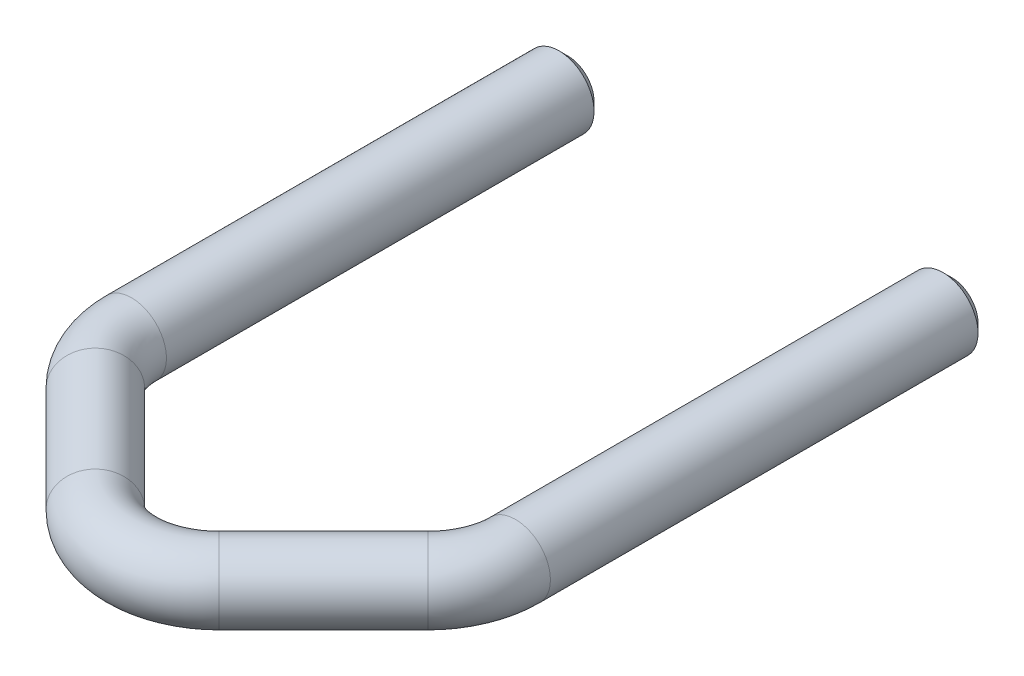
ISO-10303-21;
HEADER;
FILE_DESCRIPTION(('STEP AP214'),'2;1');
FILE_NAME('part.step','',(''),(''),'','','');
FILE_SCHEMA(('AUTOMOTIVE_DESIGN { 1 0 10303 214 1 1 1 1 }'));
ENDSEC;
DATA;
#1=APPLICATION_CONTEXT('core data for automotive mechanical design processes');
#2=APPLICATION_PROTOCOL_DEFINITION('international standard','automotive_design',2000,#1);
#3=PRODUCT_CONTEXT('',#1,'mechanical');
#4=PRODUCT('Part','Part','',(#3));
#5=PRODUCT_RELATED_PRODUCT_CATEGORY('part','',(#4));
#6=PRODUCT_DEFINITION_FORMATION('','',#4);
#7=PRODUCT_DEFINITION_CONTEXT('part definition',#1,'design');
#8=PRODUCT_DEFINITION('design','',#6,#7);
#9=PRODUCT_DEFINITION_SHAPE('','',#8);
#10=(LENGTH_UNIT() NAMED_UNIT(*) SI_UNIT(.MILLI.,.METRE.));
#11=(NAMED_UNIT(*) PLANE_ANGLE_UNIT() SI_UNIT($,.RADIAN.));
#12=(NAMED_UNIT(*) SI_UNIT($,.STERADIAN.) SOLID_ANGLE_UNIT());
#13=UNCERTAINTY_MEASURE_WITH_UNIT(LENGTH_MEASURE(1.E-05),#10,'distance_accuracy_value','');
#14=(GEOMETRIC_REPRESENTATION_CONTEXT(3) GLOBAL_UNCERTAINTY_ASSIGNED_CONTEXT((#13)) GLOBAL_UNIT_ASSIGNED_CONTEXT((#10,
#11,#12)) REPRESENTATION_CONTEXT('',''));
#15=CARTESIAN_POINT('',(0.,0.,0.));
#16=DIRECTION('',(0.,0.,1.));
#17=DIRECTION('',(1.,0.,0.));
#18=AXIS2_PLACEMENT_3D('',#15,#16,#17);
#19=CARTESIAN_POINT('',(-11.,0.,25.));
#20=DIRECTION('',(0.,0.,-1.));
#21=DIRECTION('',(-1.,0.,0.));
#22=AXIS2_PLACEMENT_3D('',#19,#20,#21);
#23=CYLINDRICAL_SURFACE('',#22,2.);
#24=CARTESIAN_POINT('',(-11.,0.,0.500000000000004));
#25=DIRECTION('',(0.,0.,-1.));
#26=DIRECTION('',(-1.,0.,0.));
#27=AXIS2_PLACEMENT_3D('',#24,#25,#26);
#28=CIRCLE('',#27,2.);
#29=CARTESIAN_POINT('',(-13.,0.,0.500000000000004));
#30=VERTEX_POINT('',#29);
#31=EDGE_CURVE('E41',#30,#30,#28,.F.);
#32=ORIENTED_EDGE('',*,*,#31,.T.);
#33=EDGE_LOOP('',(#32));
#34=FACE_BOUND('',#33,.T.);
#35=CARTESIAN_POINT('',(-11.,0.,25.));
#36=DIRECTION('',(0.,0.,-1.));
#37=DIRECTION('',(-1.,0.,0.));
#38=AXIS2_PLACEMENT_3D('',#35,#36,#37);
#39=CIRCLE('',#38,2.);
#40=CARTESIAN_POINT('',(-13.,0.,25.));
#41=VERTEX_POINT('',#40);
#42=EDGE_CURVE('E50',#41,#41,#39,.T.);
#43=ORIENTED_EDGE('',*,*,#42,.T.);
#44=EDGE_LOOP('',(#43));
#45=FACE_BOUND('',#44,.T.);
#46=ADVANCED_FACE('F31',(#34,#45),#23,.T.);
#47=CARTESIAN_POINT('',(-5.99999999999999,0.,25.));
#48=DIRECTION('',(0.,-1.,0.));
#49=DIRECTION('',(0.,0.,-1.));
#50=AXIS2_PLACEMENT_3D('',#47,#48,#49);
#51=TOROIDAL_SURFACE('',#50,5.,2.);
#52=CARTESIAN_POINT('',(-9.53553390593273,0.,28.5355339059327));
#53=DIRECTION('',(-0.707106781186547,0.,-0.707106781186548));
#54=DIRECTION('',(-0.707106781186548,0.,0.707106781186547));
#55=AXIS2_PLACEMENT_3D('',#52,#53,#54);
#56=CIRCLE('',#55,2.);
#57=CARTESIAN_POINT('',(-10.9497474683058,0.,29.9497474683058));
#58=VERTEX_POINT('',#57);
#59=EDGE_CURVE('E53',#58,#58,#56,.T.);
#60=CARTESIAN_POINT('',(-5.99999999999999,0.,25.));
#61=DIRECTION('',(0.,-1.,0.));
#62=DIRECTION('',(0.,0.,-1.));
#63=AXIS2_PLACEMENT_3D('',#60,#61,#62);
#64=CIRCLE('',#63,7.);
#65=EDGE_CURVE('',#58,#41,#64,.T.);
#66=ORIENTED_EDGE('',*,*,#59,.T.);
#67=ORIENTED_EDGE('',*,*,#42,.F.);
#68=ORIENTED_EDGE('',*,*,#65,.T.);
#69=ORIENTED_EDGE('',*,*,#65,.F.);
#70=EDGE_LOOP('',(#66,#68,#67,#69));
#71=FACE_BOUND('',#70,.T.);
#72=ADVANCED_FACE('F86',(#71),#51,.T.);
#73=CARTESIAN_POINT('',(-3.53553390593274,0.,34.5355339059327));
#74=DIRECTION('',(-0.707106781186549,0.,-0.707106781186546));
#75=DIRECTION('',(-0.707106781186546,0.,0.707106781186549));
#76=AXIS2_PLACEMENT_3D('',#73,#74,#75);
#77=CYLINDRICAL_SURFACE('',#76,2.);
#78=CARTESIAN_POINT('',(-3.53553390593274,0.,34.5355339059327));
#79=DIRECTION('',(-0.707106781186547,0.,-0.707106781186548));
#80=DIRECTION('',(-0.707106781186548,0.,0.707106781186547));
#81=AXIS2_PLACEMENT_3D('',#78,#79,#80);
#82=CIRCLE('',#81,2.);
#83=CARTESIAN_POINT('',(-4.94974746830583,0.,35.9497474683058));
#84=VERTEX_POINT('',#83);
#85=EDGE_CURVE('E56',#84,#84,#82,.T.);
#86=ORIENTED_EDGE('',*,*,#85,.T.);
#87=EDGE_LOOP('',(#86));
#88=FACE_BOUND('',#87,.T.);
#89=ORIENTED_EDGE('',*,*,#59,.F.);
#90=EDGE_LOOP('',(#89));
#91=FACE_BOUND('',#90,.T.);
#92=ADVANCED_FACE('F91',(#88,#91),#77,.T.);
#93=CARTESIAN_POINT('',(0.,0.,31.));
#94=DIRECTION('',(0.,-1.,0.));
#95=DIRECTION('',(0.,0.,-1.));
#96=AXIS2_PLACEMENT_3D('',#93,#94,#95);
#97=TOROIDAL_SURFACE('',#96,5.00000000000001,2.);
#98=CARTESIAN_POINT('',(3.53553390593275,0.,34.5355339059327));
#99=DIRECTION('',(-0.707106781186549,0.,0.707106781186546));
#100=DIRECTION('',(0.707106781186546,0.,0.707106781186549));
#101=AXIS2_PLACEMENT_3D('',#98,#99,#100);
#102=CIRCLE('',#101,2.);
#103=CARTESIAN_POINT('',(4.94974746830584,0.,35.9497474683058));
#104=VERTEX_POINT('',#103);
#105=EDGE_CURVE('E59',#104,#104,#102,.T.);
#106=CARTESIAN_POINT('',(0.,0.,31.));
#107=DIRECTION('',(0.,-1.,0.));
#108=DIRECTION('',(0.,0.,-1.));
#109=AXIS2_PLACEMENT_3D('',#106,#107,#108);
#110=CIRCLE('',#109,7.00000000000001);
#111=EDGE_CURVE('',#104,#84,#110,.T.);
#112=ORIENTED_EDGE('',*,*,#105,.T.);
#113=ORIENTED_EDGE('',*,*,#85,.F.);
#114=ORIENTED_EDGE('',*,*,#111,.T.);
#115=ORIENTED_EDGE('',*,*,#111,.F.);
#116=EDGE_LOOP('',(#112,#114,#113,#115));
#117=FACE_BOUND('',#116,.T.);
#118=ADVANCED_FACE('F138',(#117),#97,.T.);
#119=CARTESIAN_POINT('',(9.53553390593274,0.,28.5355339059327));
#120=DIRECTION('',(-0.707106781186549,0.,0.707106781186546));
#121=DIRECTION('',(0.707106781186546,0.,0.707106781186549));
#122=AXIS2_PLACEMENT_3D('',#119,#120,#121);
#123=CYLINDRICAL_SURFACE('',#122,2.);
#124=CARTESIAN_POINT('',(9.53553390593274,0.,28.5355339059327));
#125=DIRECTION('',(-0.707106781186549,0.,0.707106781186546));
#126=DIRECTION('',(0.707106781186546,0.,0.707106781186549));
#127=AXIS2_PLACEMENT_3D('',#124,#125,#126);
#128=CIRCLE('',#127,2.);
#129=CARTESIAN_POINT('',(10.9497474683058,0.,29.9497474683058));
#130=VERTEX_POINT('',#129);
#131=EDGE_CURVE('E62',#130,#130,#128,.T.);
#132=ORIENTED_EDGE('',*,*,#131,.T.);
#133=EDGE_LOOP('',(#132));
#134=FACE_BOUND('',#133,.T.);
#135=ORIENTED_EDGE('',*,*,#105,.F.);
#136=EDGE_LOOP('',(#135));
#137=FACE_BOUND('',#136,.T.);
#138=ADVANCED_FACE('F83',(#134,#137),#123,.T.);
#139=CARTESIAN_POINT('',(6.00000000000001,0.,25.));
#140=DIRECTION('',(0.,-1.,0.));
#141=DIRECTION('',(0.,0.,-1.));
#142=AXIS2_PLACEMENT_3D('',#139,#140,#141);
#143=TOROIDAL_SURFACE('',#142,5.,2.);
#144=CARTESIAN_POINT('',(11.,0.,25.));
#145=DIRECTION('',(0.,0.,1.));
#146=DIRECTION('',(1.,0.,0.));
#147=AXIS2_PLACEMENT_3D('',#144,#145,#146);
#148=CIRCLE('',#147,2.);
#149=CARTESIAN_POINT('',(13.,0.,25.));
#150=VERTEX_POINT('',#149);
#151=EDGE_CURVE('E65',#150,#150,#148,.T.);
#152=CARTESIAN_POINT('',(6.00000000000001,0.,25.));
#153=DIRECTION('',(0.,-1.,0.));
#154=DIRECTION('',(0.,0.,-1.));
#155=AXIS2_PLACEMENT_3D('',#152,#153,#154);
#156=CIRCLE('',#155,7.);
#157=EDGE_CURVE('',#150,#130,#156,.T.);
#158=ORIENTED_EDGE('',*,*,#151,.T.);
#159=ORIENTED_EDGE('',*,*,#131,.F.);
#160=ORIENTED_EDGE('',*,*,#157,.T.);
#161=ORIENTED_EDGE('',*,*,#157,.F.);
#162=EDGE_LOOP('',(#158,#160,#159,#161));
#163=FACE_BOUND('',#162,.T.);
#164=ADVANCED_FACE('F69',(#163),#143,.T.);
#165=CARTESIAN_POINT('',(11.,0.,25.));
#166=DIRECTION('',(0.,0.,-1.));
#167=DIRECTION('',(-1.,0.,0.));
#168=AXIS2_PLACEMENT_3D('',#165,#166,#167);
#169=CYLINDRICAL_SURFACE('',#168,2.);
#170=CARTESIAN_POINT('',(11.,0.,0.500000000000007));
#171=DIRECTION('',(0.,0.,1.));
#172=DIRECTION('',(1.,0.,0.));
#173=AXIS2_PLACEMENT_3D('',#170,#171,#172);
#174=CIRCLE('',#173,2.);
#175=CARTESIAN_POINT('',(13.,0.,0.500000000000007));
#176=VERTEX_POINT('',#175);
#177=EDGE_CURVE('E37',#176,#176,#174,.T.);
#178=ORIENTED_EDGE('',*,*,#177,.T.);
#179=EDGE_LOOP('',(#178));
#180=FACE_BOUND('',#179,.T.);
#181=ORIENTED_EDGE('',*,*,#151,.F.);
#182=EDGE_LOOP('',(#181));
#183=FACE_BOUND('',#182,.T.);
#184=ADVANCED_FACE('F72',(#180,#183),#169,.T.);
#185=CARTESIAN_POINT('',(-11.,0.,0.));
#186=DIRECTION('',(0.,0.,-1.));
#187=DIRECTION('',(-1.,0.,0.));
#188=AXIS2_PLACEMENT_3D('',#185,#186,#187);
#189=PLANE('',#188);
#190=CARTESIAN_POINT('',(-11.,0.,0.));
#191=DIRECTION('',(0.,0.,-1.));
#192=DIRECTION('',(-1.,0.,0.));
#193=AXIS2_PLACEMENT_3D('',#190,#191,#192);
#194=CIRCLE('',#193,1.49999999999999);
#195=CARTESIAN_POINT('',(-12.5,0.,0.));
#196=VERTEX_POINT('',#195);
#197=EDGE_CURVE('E45',#196,#196,#194,.T.);
#198=ORIENTED_EDGE('',*,*,#197,.T.);
#199=EDGE_LOOP('',(#198));
#200=FACE_BOUND('',#199,.T.);
#201=ADVANCED_FACE('F74',(#200),#189,.T.);
#202=CARTESIAN_POINT('',(11.,0.,0.));
#203=DIRECTION('',(0.,0.,1.));
#204=DIRECTION('',(1.,0.,0.));
#205=AXIS2_PLACEMENT_3D('',#202,#203,#204);
#206=PLANE('',#205);
#207=CARTESIAN_POINT('',(11.,0.,0.));
#208=DIRECTION('',(0.,0.,1.));
#209=DIRECTION('',(1.,0.,0.));
#210=AXIS2_PLACEMENT_3D('',#207,#208,#209);
#211=CIRCLE('',#210,1.5);
#212=CARTESIAN_POINT('',(12.5,0.,0.));
#213=VERTEX_POINT('',#212);
#214=EDGE_CURVE('E10',#213,#213,#211,.F.);
#215=ORIENTED_EDGE('',*,*,#214,.T.);
#216=EDGE_LOOP('',(#215));
#217=FACE_BOUND('',#216,.T.);
#218=ADVANCED_FACE('F80',(#217),#206,.F.);
#219=CARTESIAN_POINT('',(-11.,0.,0.));
#220=DIRECTION('',(0.,0.,1.));
#221=DIRECTION('',(1.,0.,0.));
#222=AXIS2_PLACEMENT_3D('',#219,#220,#221);
#223=CONICAL_SURFACE('',#222,1.49999999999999,0.785398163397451);
#224=ORIENTED_EDGE('',*,*,#31,.F.);
#225=EDGE_LOOP('',(#224));
#226=FACE_BOUND('',#225,.T.);
#227=ORIENTED_EDGE('',*,*,#197,.F.);
#228=EDGE_LOOP('',(#227));
#229=FACE_BOUND('',#228,.T.);
#230=ADVANCED_FACE('F98',(#226,#229),#223,.T.);
#231=CARTESIAN_POINT('',(11.,0.,0.500000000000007));
#232=DIRECTION('',(0.,0.,1.));
#233=DIRECTION('',(1.,0.,0.));
#234=AXIS2_PLACEMENT_3D('',#231,#232,#233);
#235=CONICAL_SURFACE('',#234,2.,0.785398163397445);
#236=ORIENTED_EDGE('',*,*,#214,.F.);
#237=EDGE_LOOP('',(#236));
#238=FACE_BOUND('',#237,.T.);
#239=ORIENTED_EDGE('',*,*,#177,.F.);
#240=EDGE_LOOP('',(#239));
#241=FACE_BOUND('',#240,.T.);
#242=ADVANCED_FACE('F101',(#238,#241),#235,.T.);
#243=CLOSED_SHELL('',(#46,#72,#92,#118,#138,#164,#184,#201,#218,#230,#242));
#244=MANIFOLD_SOLID_BREP('B2',#243);
#245=ADVANCED_BREP_SHAPE_REPRESENTATION('',(#18,#244),#14);
#246=SHAPE_DEFINITION_REPRESENTATION(#9,#245);
ENDSEC;
END-ISO-10303-21;
